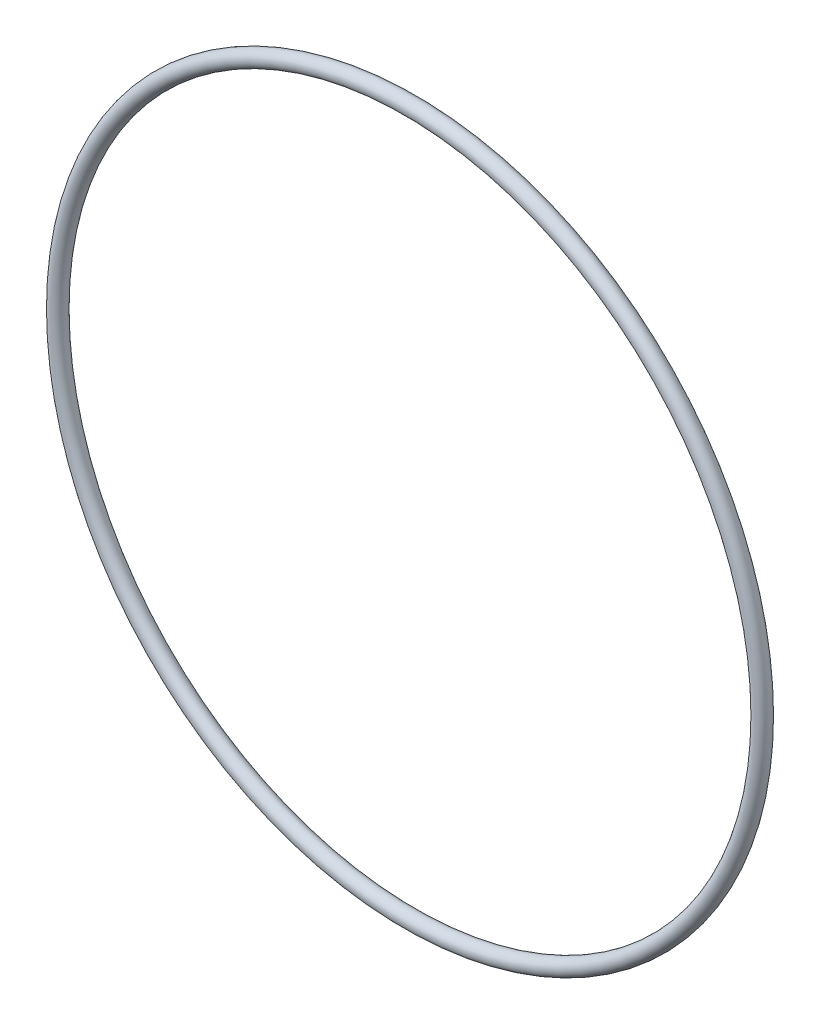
ISO-10303-21;
HEADER;
FILE_DESCRIPTION(('STEP AP214'),'2;1');
FILE_NAME('part.step','',(''),(''),'','','');
FILE_SCHEMA(('AUTOMOTIVE_DESIGN { 1 0 10303 214 1 1 1 1 }'));
ENDSEC;
DATA;
#1=APPLICATION_CONTEXT('core data for automotive mechanical design processes');
#2=APPLICATION_PROTOCOL_DEFINITION('international standard','automotive_design',2000,#1);
#3=PRODUCT_CONTEXT('',#1,'mechanical');
#4=PRODUCT('Part','Part','',(#3));
#5=PRODUCT_RELATED_PRODUCT_CATEGORY('part','',(#4));
#6=PRODUCT_DEFINITION_FORMATION('','',#4);
#7=PRODUCT_DEFINITION_CONTEXT('part definition',#1,'design');
#8=PRODUCT_DEFINITION('design','',#6,#7);
#9=PRODUCT_DEFINITION_SHAPE('','',#8);
#10=(LENGTH_UNIT() NAMED_UNIT(*) SI_UNIT(.MILLI.,.METRE.));
#11=(NAMED_UNIT(*) PLANE_ANGLE_UNIT() SI_UNIT($,.RADIAN.));
#12=(NAMED_UNIT(*) SI_UNIT($,.STERADIAN.) SOLID_ANGLE_UNIT());
#13=UNCERTAINTY_MEASURE_WITH_UNIT(LENGTH_MEASURE(1.E-05),#10,'distance_accuracy_value','');
#14=(GEOMETRIC_REPRESENTATION_CONTEXT(3) GLOBAL_UNCERTAINTY_ASSIGNED_CONTEXT((#13)) GLOBAL_UNIT_ASSIGNED_CONTEXT((#10,
#11,#12)) REPRESENTATION_CONTEXT('',''));
#15=CARTESIAN_POINT('',(0.,0.,0.));
#16=DIRECTION('',(0.,0.,1.));
#17=DIRECTION('',(1.,0.,0.));
#18=AXIS2_PLACEMENT_3D('',#15,#16,#17);
#19=CARTESIAN_POINT('',(0.,0.,0.));
#20=DIRECTION('',(0.,0.,1.));
#21=DIRECTION('',(1.,0.,0.));
#22=AXIS2_PLACEMENT_3D('',#19,#20,#21);
#23=TOROIDAL_SURFACE('',#22,77.7621,1.7653);
#24=CARTESIAN_POINT('',(79.5274,0.,0.));
#25=VERTEX_POINT('',#24);
#26=VERTEX_LOOP('',#25);
#27=FACE_BOUND('',#26,.T.);
#28=ADVANCED_FACE('F33',(#27),#23,.T.);
#29=CLOSED_SHELL('',(#28));
#30=MANIFOLD_SOLID_BREP('B2',#29);
#31=ADVANCED_BREP_SHAPE_REPRESENTATION('',(#18,#30),#14);
#32=SHAPE_DEFINITION_REPRESENTATION(#9,#31);
ENDSEC;
END-ISO-10303-21;
